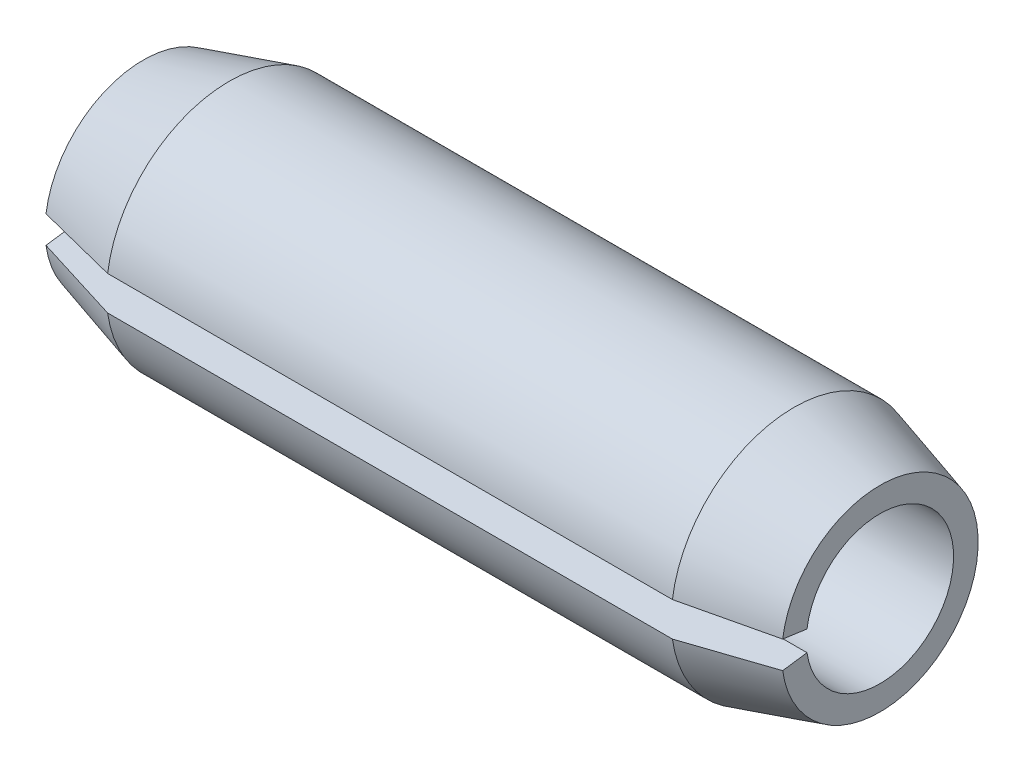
ISO-10303-21;
HEADER;
FILE_DESCRIPTION(('STEP AP214'),'2;1');
FILE_NAME('part.step','',(''),(''),'','','');
FILE_SCHEMA(('AUTOMOTIVE_DESIGN { 1 0 10303 214 1 1 1 1 }'));
ENDSEC;
DATA;
#1=APPLICATION_CONTEXT('core data for automotive mechanical design processes');
#2=APPLICATION_PROTOCOL_DEFINITION('international standard','automotive_design',2000,#1);
#3=PRODUCT_CONTEXT('',#1,'mechanical');
#4=PRODUCT('Part','Part','',(#3));
#5=PRODUCT_RELATED_PRODUCT_CATEGORY('part','',(#4));
#6=PRODUCT_DEFINITION_FORMATION('','',#4);
#7=PRODUCT_DEFINITION_CONTEXT('part definition',#1,'design');
#8=PRODUCT_DEFINITION('design','',#6,#7);
#9=PRODUCT_DEFINITION_SHAPE('','',#8);
#10=(LENGTH_UNIT() NAMED_UNIT(*) SI_UNIT(.MILLI.,.METRE.));
#11=(NAMED_UNIT(*) PLANE_ANGLE_UNIT() SI_UNIT($,.RADIAN.));
#12=(NAMED_UNIT(*) SI_UNIT($,.STERADIAN.) SOLID_ANGLE_UNIT());
#13=UNCERTAINTY_MEASURE_WITH_UNIT(LENGTH_MEASURE(1.E-05),#10,'distance_accuracy_value','');
#14=(GEOMETRIC_REPRESENTATION_CONTEXT(3) GLOBAL_UNCERTAINTY_ASSIGNED_CONTEXT((#13)) GLOBAL_UNIT_ASSIGNED_CONTEXT((#10,
#11,#12)) REPRESENTATION_CONTEXT('',''));
#15=CARTESIAN_POINT('',(0.,0.,0.));
#16=DIRECTION('',(0.,0.,1.));
#17=DIRECTION('',(1.,0.,0.));
#18=AXIS2_PLACEMENT_3D('',#15,#16,#17);
#19=CARTESIAN_POINT('',(3.,0.,0.));
#20=DIRECTION('',(-1.,0.,0.));
#21=DIRECTION('',(0.,0.,1.));
#22=AXIS2_PLACEMENT_3D('',#19,#20,#21);
#23=CYLINDRICAL_SURFACE('',#22,0.5);
#24=DIRECTION('',(-1.,0.,0.));
#25=VECTOR('',#24,1.);
#26=CARTESIAN_POINT('',(3.,-0.069586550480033,0.495134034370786));
#27=LINE('',#26,#25);
#28=CARTESIAN_POINT('',(0.35,-0.069586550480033,0.495134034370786));
#29=VERTEX_POINT('',#28);
#30=CARTESIAN_POINT('',(2.65,-0.069586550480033,0.495134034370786));
#31=VERTEX_POINT('',#30);
#32=EDGE_CURVE('E121',#29,#31,#27,.F.);
#33=ORIENTED_EDGE('',*,*,#32,.F.);
#34=CARTESIAN_POINT('',(0.35,0.,0.));
#35=DIRECTION('',(-1.,0.,0.));
#36=DIRECTION('',(0.,0.,1.));
#37=AXIS2_PLACEMENT_3D('',#34,#35,#36);
#38=CIRCLE('',#37,0.5);
#39=CARTESIAN_POINT('',(0.35,0.0695865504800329,0.495134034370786));
#40=VERTEX_POINT('',#39);
#41=EDGE_CURVE('E115',#40,#29,#38,.T.);
#42=ORIENTED_EDGE('',*,*,#41,.F.);
#43=DIRECTION('',(-1.,0.,0.));
#44=VECTOR('',#43,1.);
#45=CARTESIAN_POINT('',(3.,0.0695865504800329,0.495134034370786));
#46=LINE('',#45,#44);
#47=CARTESIAN_POINT('',(2.65,0.0695865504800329,0.495134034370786));
#48=VERTEX_POINT('',#47);
#49=EDGE_CURVE('E54',#48,#40,#46,.T.);
#50=ORIENTED_EDGE('',*,*,#49,.F.);
#51=CARTESIAN_POINT('',(2.65,0.,0.));
#52=DIRECTION('',(-1.,0.,0.));
#53=DIRECTION('',(0.,0.,1.));
#54=AXIS2_PLACEMENT_3D('',#51,#52,#53);
#55=CIRCLE('',#54,0.5);
#56=EDGE_CURVE('E107',#48,#31,#55,.T.);
#57=ORIENTED_EDGE('',*,*,#56,.T.);
#58=EDGE_LOOP('',(#33,#42,#50,#57));
#59=FACE_BOUND('',#58,.T.);
#60=ADVANCED_FACE('F33',(#59),#23,.T.);
#61=CARTESIAN_POINT('',(0.,0.,0.));
#62=DIRECTION('',(1.,0.,0.));
#63=DIRECTION('',(0.,0.,-1.));
#64=AXIS2_PLACEMENT_3D('',#61,#62,#63);
#65=PLANE('',#64);
#66=DIRECTION('',(0.,0.139173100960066,-0.99026806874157));
#67=VECTOR('',#66,1.);
#68=CARTESIAN_POINT('',(0.,0.,0.));
#69=LINE('',#68,#67);
#70=CARTESIAN_POINT('',(0.,-0.0556692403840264,0.396107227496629));
#71=VERTEX_POINT('',#70);
#72=CARTESIAN_POINT('',(0.,-0.0417519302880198,0.297080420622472));
#73=VERTEX_POINT('',#72);
#74=EDGE_CURVE('E47',#71,#73,#69,.T.);
#75=ORIENTED_EDGE('',*,*,#74,.T.);
#76=CARTESIAN_POINT('',(0.,0.,0.));
#77=DIRECTION('',(1.,0.,0.));
#78=DIRECTION('',(0.,0.,-1.));
#79=AXIS2_PLACEMENT_3D('',#76,#77,#78);
#80=CIRCLE('',#79,0.3);
#81=CARTESIAN_POINT('',(0.,0.0417519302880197,0.297080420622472));
#82=VERTEX_POINT('',#81);
#83=EDGE_CURVE('E98',#73,#82,#80,.T.);
#84=ORIENTED_EDGE('',*,*,#83,.T.);
#85=DIRECTION('',(0.,0.139173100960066,0.99026806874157));
#86=VECTOR('',#85,1.);
#87=CARTESIAN_POINT('',(0.,0.,0.));
#88=LINE('',#87,#86);
#89=CARTESIAN_POINT('',(0.,0.0556692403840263,0.396107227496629));
#90=VERTEX_POINT('',#89);
#91=EDGE_CURVE('E100',#82,#90,#88,.T.);
#92=ORIENTED_EDGE('',*,*,#91,.T.);
#93=CARTESIAN_POINT('',(0.,0.,0.));
#94=DIRECTION('',(-1.,0.,0.));
#95=DIRECTION('',(0.,0.,1.));
#96=AXIS2_PLACEMENT_3D('',#93,#94,#95);
#97=CIRCLE('',#96,0.4);
#98=EDGE_CURVE('E90',#90,#71,#97,.T.);
#99=ORIENTED_EDGE('',*,*,#98,.T.);
#100=EDGE_LOOP('',(#75,#84,#92,#99));
#101=FACE_BOUND('',#100,.T.);
#102=ADVANCED_FACE('F96',(#101),#65,.F.);
#103=CARTESIAN_POINT('',(3.,0.,0.));
#104=DIRECTION('',(1.,0.,0.));
#105=DIRECTION('',(0.,0.,-1.));
#106=AXIS2_PLACEMENT_3D('',#103,#104,#105);
#107=PLANE('',#106);
#108=CARTESIAN_POINT('',(3.,0.,0.));
#109=DIRECTION('',(1.,0.,0.));
#110=DIRECTION('',(0.,0.,-1.));
#111=AXIS2_PLACEMENT_3D('',#108,#109,#110);
#112=CIRCLE('',#111,0.3);
#113=CARTESIAN_POINT('',(3.,-0.0417519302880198,0.297080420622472));
#114=VERTEX_POINT('',#113);
#115=CARTESIAN_POINT('',(3.,0.0417519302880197,0.297080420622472));
#116=VERTEX_POINT('',#115);
#117=EDGE_CURVE('E105',#114,#116,#112,.T.);
#118=ORIENTED_EDGE('',*,*,#117,.F.);
#119=DIRECTION('',(0.,0.139173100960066,-0.99026806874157));
#120=VECTOR('',#119,1.);
#121=CARTESIAN_POINT('',(3.,0.,0.));
#122=LINE('',#121,#120);
#123=CARTESIAN_POINT('',(3.,-0.0556692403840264,0.396107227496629));
#124=VERTEX_POINT('',#123);
#125=EDGE_CURVE('E85',#124,#114,#122,.T.);
#126=ORIENTED_EDGE('',*,*,#125,.F.);
#127=CARTESIAN_POINT('',(3.,0.,0.));
#128=DIRECTION('',(-1.,0.,0.));
#129=DIRECTION('',(0.,0.,1.));
#130=AXIS2_PLACEMENT_3D('',#127,#128,#129);
#131=CIRCLE('',#130,0.4);
#132=CARTESIAN_POINT('',(3.,0.0556692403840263,0.396107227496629));
#133=VERTEX_POINT('',#132);
#134=EDGE_CURVE('E112',#133,#124,#131,.T.);
#135=ORIENTED_EDGE('',*,*,#134,.F.);
#136=DIRECTION('',(0.,0.139173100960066,0.99026806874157));
#137=VECTOR('',#136,1.);
#138=CARTESIAN_POINT('',(3.,0.,0.));
#139=LINE('',#138,#137);
#140=EDGE_CURVE('E128',#116,#133,#139,.T.);
#141=ORIENTED_EDGE('',*,*,#140,.F.);
#142=EDGE_LOOP('',(#118,#126,#135,#141));
#143=FACE_BOUND('',#142,.T.);
#144=ADVANCED_FACE('F138',(#143),#107,.T.);
#145=CARTESIAN_POINT('',(4.13137084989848,0.,0.));
#146=DIRECTION('',(-1.,0.,0.));
#147=DIRECTION('',(0.,0.,1.));
#148=AXIS2_PLACEMENT_3D('',#145,#146,#147);
#149=CYLINDRICAL_SURFACE('',#148,0.3);
#150=ORIENTED_EDGE('',*,*,#83,.F.);
#151=DIRECTION('',(-1.,0.,0.));
#152=VECTOR('',#151,1.);
#153=CARTESIAN_POINT('',(4.13137084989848,-0.0417519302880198,0.297080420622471));
#154=LINE('',#153,#152);
#155=EDGE_CURVE('E82',#73,#114,#154,.F.);
#156=ORIENTED_EDGE('',*,*,#155,.T.);
#157=ORIENTED_EDGE('',*,*,#117,.T.);
#158=DIRECTION('',(-1.,0.,0.));
#159=VECTOR('',#158,1.);
#160=CARTESIAN_POINT('',(4.13137084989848,0.0417519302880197,0.297080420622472));
#161=LINE('',#160,#159);
#162=EDGE_CURVE('E104',#116,#82,#161,.T.);
#163=ORIENTED_EDGE('',*,*,#162,.T.);
#164=EDGE_LOOP('',(#150,#156,#157,#163));
#165=FACE_BOUND('',#164,.T.);
#166=ADVANCED_FACE('F103',(#165),#149,.F.);
#167=CARTESIAN_POINT('',(2.65,0.,0.));
#168=DIRECTION('',(-1.,0.,0.));
#169=DIRECTION('',(0.,0.,1.));
#170=AXIS2_PLACEMENT_3D('',#167,#168,#169);
#171=CONICAL_SURFACE('',#170,0.5,0.278299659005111);
#172=ORIENTED_EDGE('',*,*,#134,.T.);
#173=DIRECTION('',(0.961523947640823,0.0382337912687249,-0.272047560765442));
#174=VECTOR('',#173,1.);
#175=CARTESIAN_POINT('',(4.4,0.,0.));
#176=LINE('',#175,#174);
#177=EDGE_CURVE('E91',#124,#31,#176,.F.);
#178=ORIENTED_EDGE('',*,*,#177,.T.);
#179=ORIENTED_EDGE('',*,*,#56,.F.);
#180=DIRECTION('',(-0.961523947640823,0.0382337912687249,0.272047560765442));
#181=VECTOR('',#180,1.);
#182=CARTESIAN_POINT('',(4.4,0.,0.));
#183=LINE('',#182,#181);
#184=EDGE_CURVE('E124',#48,#133,#183,.F.);
#185=ORIENTED_EDGE('',*,*,#184,.T.);
#186=EDGE_LOOP('',(#172,#178,#179,#185));
#187=FACE_BOUND('',#186,.T.);
#188=ADVANCED_FACE('F137',(#187),#171,.T.);
#189=CARTESIAN_POINT('',(0.,0.,0.));
#190=DIRECTION('',(1.,0.,0.));
#191=DIRECTION('',(0.,0.,-1.));
#192=AXIS2_PLACEMENT_3D('',#189,#190,#191);
#193=CONICAL_SURFACE('',#192,0.4,0.278299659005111);
#194=ORIENTED_EDGE('',*,*,#41,.T.);
#195=DIRECTION('',(0.961523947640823,-0.0382337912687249,0.272047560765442));
#196=VECTOR('',#195,1.);
#197=CARTESIAN_POINT('',(-1.4,0.,0.));
#198=LINE('',#197,#196);
#199=EDGE_CURVE('E11',#29,#71,#198,.F.);
#200=ORIENTED_EDGE('',*,*,#199,.T.);
#201=ORIENTED_EDGE('',*,*,#98,.F.);
#202=DIRECTION('',(-0.961523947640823,-0.0382337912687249,-0.272047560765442));
#203=VECTOR('',#202,1.);
#204=CARTESIAN_POINT('',(-1.4,0.,0.));
#205=LINE('',#204,#203);
#206=EDGE_CURVE('E40',#90,#40,#205,.F.);
#207=ORIENTED_EDGE('',*,*,#206,.T.);
#208=EDGE_LOOP('',(#194,#200,#201,#207));
#209=FACE_BOUND('',#208,.T.);
#210=ADVANCED_FACE('F153',(#209),#193,.T.);
#211=CARTESIAN_POINT('',(3.,0.,0.));
#212=DIRECTION('',(0.,-0.99026806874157,0.139173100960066));
#213=DIRECTION('',(0.,-0.139173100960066,-0.99026806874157));
#214=AXIS2_PLACEMENT_3D('',#211,#212,#213);
#215=PLANE('',#214);
#216=ORIENTED_EDGE('',*,*,#140,.T.);
#217=ORIENTED_EDGE('',*,*,#184,.F.);
#218=ORIENTED_EDGE('',*,*,#49,.T.);
#219=ORIENTED_EDGE('',*,*,#206,.F.);
#220=ORIENTED_EDGE('',*,*,#91,.F.);
#221=ORIENTED_EDGE('',*,*,#162,.F.);
#222=EDGE_LOOP('',(#216,#217,#218,#219,#220,#221));
#223=FACE_BOUND('',#222,.T.);
#224=ADVANCED_FACE('F132',(#223),#215,.T.);
#225=CARTESIAN_POINT('',(3.,0.,0.));
#226=DIRECTION('',(0.,0.99026806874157,0.139173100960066));
#227=DIRECTION('',(0.,-0.139173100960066,0.99026806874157));
#228=AXIS2_PLACEMENT_3D('',#225,#226,#227);
#229=PLANE('',#228);
#230=ORIENTED_EDGE('',*,*,#74,.F.);
#231=ORIENTED_EDGE('',*,*,#199,.F.);
#232=ORIENTED_EDGE('',*,*,#32,.T.);
#233=ORIENTED_EDGE('',*,*,#177,.F.);
#234=ORIENTED_EDGE('',*,*,#125,.T.);
#235=ORIENTED_EDGE('',*,*,#155,.F.);
#236=EDGE_LOOP('',(#230,#231,#232,#233,#234,#235));
#237=FACE_BOUND('',#236,.T.);
#238=ADVANCED_FACE('F83',(#237),#229,.T.);
#239=CLOSED_SHELL('',(#60,#102,#144,#166,#188,#210,#224,#238));
#240=MANIFOLD_SOLID_BREP('B2',#239);
#241=ADVANCED_BREP_SHAPE_REPRESENTATION('',(#18,#240),#14);
#242=SHAPE_DEFINITION_REPRESENTATION(#9,#241);
ENDSEC;
END-ISO-10303-21;
